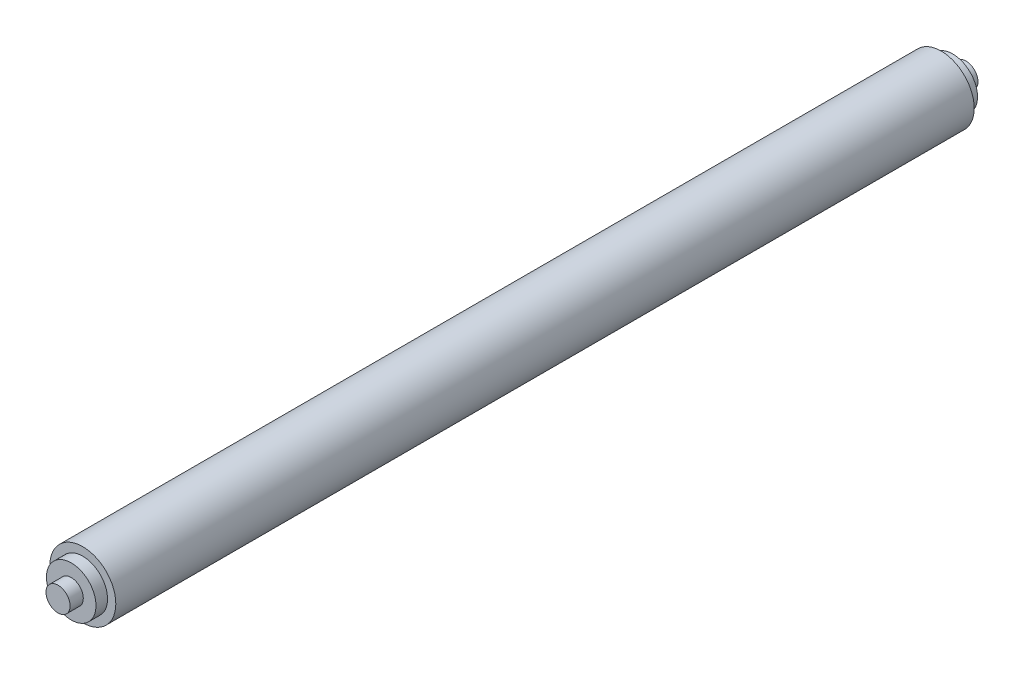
ISO-10303-21;
HEADER;
FILE_DESCRIPTION(('STEP AP214'),'2;1');
FILE_NAME('part.step','',(''),(''),'','','');
FILE_SCHEMA(('AUTOMOTIVE_DESIGN { 1 0 10303 214 1 1 1 1 }'));
ENDSEC;
DATA;
#1=APPLICATION_CONTEXT('core data for automotive mechanical design processes');
#2=APPLICATION_PROTOCOL_DEFINITION('international standard','automotive_design',2000,#1);
#3=PRODUCT_CONTEXT('',#1,'mechanical');
#4=PRODUCT('Part','Part','',(#3));
#5=PRODUCT_RELATED_PRODUCT_CATEGORY('part','',(#4));
#6=PRODUCT_DEFINITION_FORMATION('','',#4);
#7=PRODUCT_DEFINITION_CONTEXT('part definition',#1,'design');
#8=PRODUCT_DEFINITION('design','',#6,#7);
#9=PRODUCT_DEFINITION_SHAPE('','',#8);
#10=(LENGTH_UNIT() NAMED_UNIT(*) SI_UNIT(.MILLI.,.METRE.));
#11=(NAMED_UNIT(*) PLANE_ANGLE_UNIT() SI_UNIT($,.RADIAN.));
#12=(NAMED_UNIT(*) SI_UNIT($,.STERADIAN.) SOLID_ANGLE_UNIT());
#13=UNCERTAINTY_MEASURE_WITH_UNIT(LENGTH_MEASURE(1.E-05),#10,'distance_accuracy_value','');
#14=(GEOMETRIC_REPRESENTATION_CONTEXT(3) GLOBAL_UNCERTAINTY_ASSIGNED_CONTEXT((#13)) GLOBAL_UNIT_ASSIGNED_CONTEXT((#10,
#11,#12)) REPRESENTATION_CONTEXT('',''));
#15=CARTESIAN_POINT('',(0.,0.,0.));
#16=DIRECTION('',(0.,0.,1.));
#17=DIRECTION('',(1.,0.,0.));
#18=AXIS2_PLACEMENT_3D('',#15,#16,#17);
#19=CARTESIAN_POINT('',(0.,0.,-349.25));
#20=DIRECTION('',(0.,0.,1.));
#21=DIRECTION('',(1.,0.,0.));
#22=AXIS2_PLACEMENT_3D('',#19,#20,#21);
#23=CYLINDRICAL_SURFACE('',#22,19.05);
#24=CARTESIAN_POINT('',(0.,0.,-330.2));
#25=DIRECTION('',(0.,0.,1.));
#26=DIRECTION('',(1.,0.,0.));
#27=AXIS2_PLACEMENT_3D('',#24,#25,#26);
#28=CIRCLE('',#27,19.05);
#29=CARTESIAN_POINT('',(19.05,0.,-330.2));
#30=VERTEX_POINT('',#29);
#31=EDGE_CURVE('E52',#30,#30,#28,.T.);
#32=CARTESIAN_POINT('',(0.,0.,-339.09));
#33=DIRECTION('',(0.,0.,1.));
#34=DIRECTION('',(1.,0.,0.));
#35=AXIS2_PLACEMENT_3D('',#32,#33,#34);
#36=CIRCLE('',#35,19.05);
#37=CARTESIAN_POINT('',(19.05,0.,-339.09));
#38=VERTEX_POINT('',#37);
#39=EDGE_CURVE('E57',#38,#38,#36,.T.);
#40=CARTESIAN_POINT('',(19.05,0.,-330.2));
#41=CARTESIAN_POINT('',(19.05,0.,-330.292604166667));
#42=CARTESIAN_POINT('',(19.05,0.,-330.385208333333));
#43=CARTESIAN_POINT('',(19.05,0.,-330.570416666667));
#44=CARTESIAN_POINT('',(19.05,0.,-330.663020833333));
#45=CARTESIAN_POINT('',(19.05,0.,-330.848229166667));
#46=CARTESIAN_POINT('',(19.05,0.,-330.940833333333));
#47=CARTESIAN_POINT('',(19.05,0.,-331.126041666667));
#48=CARTESIAN_POINT('',(19.05,0.,-331.218645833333));
#49=CARTESIAN_POINT('',(19.05,0.,-331.403854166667));
#50=CARTESIAN_POINT('',(19.05,0.,-331.496458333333));
#51=CARTESIAN_POINT('',(19.05,0.,-331.681666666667));
#52=CARTESIAN_POINT('',(19.05,0.,-331.774270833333));
#53=CARTESIAN_POINT('',(19.05,0.,-331.959479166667));
#54=CARTESIAN_POINT('',(19.05,0.,-332.052083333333));
#55=CARTESIAN_POINT('',(19.05,0.,-332.237291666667));
#56=CARTESIAN_POINT('',(19.05,0.,-332.329895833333));
#57=CARTESIAN_POINT('',(19.05,0.,-332.515104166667));
#58=CARTESIAN_POINT('',(19.05,0.,-332.607708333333));
#59=CARTESIAN_POINT('',(19.05,0.,-332.792916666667));
#60=CARTESIAN_POINT('',(19.05,0.,-332.885520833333));
#61=CARTESIAN_POINT('',(19.05,0.,-333.070729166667));
#62=CARTESIAN_POINT('',(19.05,0.,-333.163333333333));
#63=CARTESIAN_POINT('',(19.05,0.,-333.348541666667));
#64=CARTESIAN_POINT('',(19.05,0.,-333.441145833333));
#65=CARTESIAN_POINT('',(19.05,0.,-333.626354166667));
#66=CARTESIAN_POINT('',(19.05,0.,-333.718958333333));
#67=CARTESIAN_POINT('',(19.05,0.,-333.904166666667));
#68=CARTESIAN_POINT('',(19.05,0.,-333.996770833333));
#69=CARTESIAN_POINT('',(19.05,0.,-334.181979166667));
#70=CARTESIAN_POINT('',(19.05,0.,-334.274583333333));
#71=CARTESIAN_POINT('',(19.05,0.,-334.459791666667));
#72=CARTESIAN_POINT('',(19.05,0.,-334.552395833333));
#73=CARTESIAN_POINT('',(19.05,0.,-334.737604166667));
#74=CARTESIAN_POINT('',(19.05,0.,-334.830208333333));
#75=CARTESIAN_POINT('',(19.05,0.,-335.015416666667));
#76=CARTESIAN_POINT('',(19.05,0.,-335.108020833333));
#77=CARTESIAN_POINT('',(19.05,0.,-335.293229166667));
#78=CARTESIAN_POINT('',(19.05,0.,-335.385833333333));
#79=CARTESIAN_POINT('',(19.05,0.,-335.571041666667));
#80=CARTESIAN_POINT('',(19.05,0.,-335.663645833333));
#81=CARTESIAN_POINT('',(19.05,0.,-335.848854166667));
#82=CARTESIAN_POINT('',(19.05,0.,-335.941458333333));
#83=CARTESIAN_POINT('',(19.05,0.,-336.126666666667));
#84=CARTESIAN_POINT('',(19.05,0.,-336.219270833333));
#85=CARTESIAN_POINT('',(19.05,0.,-336.404479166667));
#86=CARTESIAN_POINT('',(19.05,0.,-336.497083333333));
#87=CARTESIAN_POINT('',(19.05,0.,-336.682291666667));
#88=CARTESIAN_POINT('',(19.05,0.,-336.774895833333));
#89=CARTESIAN_POINT('',(19.05,0.,-336.960104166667));
#90=CARTESIAN_POINT('',(19.05,0.,-337.052708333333));
#91=CARTESIAN_POINT('',(19.05,0.,-337.237916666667));
#92=CARTESIAN_POINT('',(19.05,0.,-337.330520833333));
#93=CARTESIAN_POINT('',(19.05,0.,-337.515729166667));
#94=CARTESIAN_POINT('',(19.05,0.,-337.608333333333));
#95=CARTESIAN_POINT('',(19.05,0.,-337.793541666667));
#96=CARTESIAN_POINT('',(19.05,0.,-337.886145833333));
#97=CARTESIAN_POINT('',(19.05,0.,-338.071354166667));
#98=CARTESIAN_POINT('',(19.05,0.,-338.163958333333));
#99=CARTESIAN_POINT('',(19.05,0.,-338.349166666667));
#100=CARTESIAN_POINT('',(19.05,0.,-338.441770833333));
#101=CARTESIAN_POINT('',(19.05,0.,-338.626979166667));
#102=CARTESIAN_POINT('',(19.05,0.,-338.719583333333));
#103=CARTESIAN_POINT('',(19.05,0.,-338.904791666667));
#104=CARTESIAN_POINT('',(19.05,0.,-338.997395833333));
#105=CARTESIAN_POINT('',(19.05,0.,-339.09));
#106=B_SPLINE_CURVE_WITH_KNOTS('',3,(#40,#41,#42,#43,#44,#45,#46,#47,#48,#49,#50,#51,#52,#53,
#54,#55,#56,#57,#58,#59,#60,#61,#62,#63,#64,#65,#66,#67,#68,#69,#70,#71,#72,#73,#74,#75,#76,#77,
#78,#79,#80,#81,#82,#83,#84,#85,#86,#87,#88,#89,#90,#91,#92,#93,#94,#95,#96,#97,#98,#99,#100,
#101,#102,#103,#104,#105),.UNSPECIFIED.,.F.,.F.,(4,2,2,2,2,2,2,2,2,2,2,2,2,2,2,2,2,2,2,2,2,2,2,
2,2,2,2,2,2,2,2,2,4),(0.,0.27781250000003,0.555625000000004,0.833437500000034,1.11125000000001,
1.38906250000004,1.66687500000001,1.94468750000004,2.22250000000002,2.50031250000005,
2.77812500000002,3.05593750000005,3.33375000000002,3.61156250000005,3.88937500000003,
4.16718750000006,4.44500000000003,4.72281250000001,5.00062500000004,5.27843750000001,
5.55625000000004,5.83406250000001,6.11187500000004,6.38968750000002,6.66750000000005,
6.94531250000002,7.22312500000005,7.50093750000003,7.77875000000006,8.05656250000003,
8.33437500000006,8.61218750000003,8.89000000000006),.UNSPECIFIED.);
#107=EDGE_CURVE('BSEAM30',#30,#38,#106,.T.);
#108=ORIENTED_EDGE('',*,*,#31,.F.);
#109=ORIENTED_EDGE('',*,*,#39,.T.);
#110=ORIENTED_EDGE('',*,*,#107,.T.);
#111=ORIENTED_EDGE('',*,*,#107,.F.);
#112=EDGE_LOOP('',(#108,#110,#109,#111));
#113=FACE_BOUND('',#112,.T.);
#114=ADVANCED_FACE('F30',(#113),#23,.T.);
#115=CARTESIAN_POINT('',(0.,0.,349.25));
#116=DIRECTION('',(0.,0.,-1.));
#117=DIRECTION('',(-1.,0.,0.));
#118=AXIS2_PLACEMENT_3D('',#115,#116,#117);
#119=CYLINDRICAL_SURFACE('',#118,19.05);
#120=CARTESIAN_POINT('',(0.,0.,330.2));
#121=DIRECTION('',(0.,0.,1.));
#122=DIRECTION('',(1.,0.,0.));
#123=AXIS2_PLACEMENT_3D('',#120,#121,#122);
#124=CIRCLE('',#123,19.05);
#125=CARTESIAN_POINT('',(-19.05,0.,330.2));
#126=VERTEX_POINT('',#125);
#127=EDGE_CURVE('E41',#126,#126,#124,.T.);
#128=CARTESIAN_POINT('',(0.,0.,339.09));
#129=DIRECTION('',(0.,0.,1.));
#130=DIRECTION('',(1.,0.,0.));
#131=AXIS2_PLACEMENT_3D('',#128,#129,#130);
#132=CIRCLE('',#131,19.05);
#133=CARTESIAN_POINT('',(-19.05,0.,339.09));
#134=VERTEX_POINT('',#133);
#135=EDGE_CURVE('E45',#134,#134,#132,.T.);
#136=CARTESIAN_POINT('',(-19.05,0.,330.2));
#137=CARTESIAN_POINT('',(-19.05,0.,330.292604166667));
#138=CARTESIAN_POINT('',(-19.05,0.,330.385208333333));
#139=CARTESIAN_POINT('',(-19.05,0.,330.570416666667));
#140=CARTESIAN_POINT('',(-19.05,0.,330.663020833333));
#141=CARTESIAN_POINT('',(-19.05,0.,330.848229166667));
#142=CARTESIAN_POINT('',(-19.05,0.,330.940833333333));
#143=CARTESIAN_POINT('',(-19.05,0.,331.126041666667));
#144=CARTESIAN_POINT('',(-19.05,0.,331.218645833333));
#145=CARTESIAN_POINT('',(-19.05,0.,331.403854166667));
#146=CARTESIAN_POINT('',(-19.05,0.,331.496458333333));
#147=CARTESIAN_POINT('',(-19.05,0.,331.681666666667));
#148=CARTESIAN_POINT('',(-19.05,0.,331.774270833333));
#149=CARTESIAN_POINT('',(-19.05,0.,331.959479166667));
#150=CARTESIAN_POINT('',(-19.05,0.,332.052083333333));
#151=CARTESIAN_POINT('',(-19.05,0.,332.237291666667));
#152=CARTESIAN_POINT('',(-19.05,0.,332.329895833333));
#153=CARTESIAN_POINT('',(-19.05,0.,332.515104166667));
#154=CARTESIAN_POINT('',(-19.05,0.,332.607708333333));
#155=CARTESIAN_POINT('',(-19.05,0.,332.792916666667));
#156=CARTESIAN_POINT('',(-19.05,0.,332.885520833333));
#157=CARTESIAN_POINT('',(-19.05,0.,333.070729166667));
#158=CARTESIAN_POINT('',(-19.05,0.,333.163333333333));
#159=CARTESIAN_POINT('',(-19.05,0.,333.348541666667));
#160=CARTESIAN_POINT('',(-19.05,0.,333.441145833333));
#161=CARTESIAN_POINT('',(-19.05,0.,333.626354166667));
#162=CARTESIAN_POINT('',(-19.05,0.,333.718958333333));
#163=CARTESIAN_POINT('',(-19.05,0.,333.904166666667));
#164=CARTESIAN_POINT('',(-19.05,0.,333.996770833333));
#165=CARTESIAN_POINT('',(-19.05,0.,334.181979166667));
#166=CARTESIAN_POINT('',(-19.05,0.,334.274583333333));
#167=CARTESIAN_POINT('',(-19.05,0.,334.459791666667));
#168=CARTESIAN_POINT('',(-19.05,0.,334.552395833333));
#169=CARTESIAN_POINT('',(-19.05,0.,334.737604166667));
#170=CARTESIAN_POINT('',(-19.05,0.,334.830208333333));
#171=CARTESIAN_POINT('',(-19.05,0.,335.015416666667));
#172=CARTESIAN_POINT('',(-19.05,0.,335.108020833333));
#173=CARTESIAN_POINT('',(-19.05,0.,335.293229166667));
#174=CARTESIAN_POINT('',(-19.05,0.,335.385833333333));
#175=CARTESIAN_POINT('',(-19.05,0.,335.571041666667));
#176=CARTESIAN_POINT('',(-19.05,0.,335.663645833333));
#177=CARTESIAN_POINT('',(-19.05,0.,335.848854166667));
#178=CARTESIAN_POINT('',(-19.05,0.,335.941458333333));
#179=CARTESIAN_POINT('',(-19.05,0.,336.126666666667));
#180=CARTESIAN_POINT('',(-19.05,0.,336.219270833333));
#181=CARTESIAN_POINT('',(-19.05,0.,336.404479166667));
#182=CARTESIAN_POINT('',(-19.05,0.,336.497083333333));
#183=CARTESIAN_POINT('',(-19.05,0.,336.682291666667));
#184=CARTESIAN_POINT('',(-19.05,0.,336.774895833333));
#185=CARTESIAN_POINT('',(-19.05,0.,336.960104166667));
#186=CARTESIAN_POINT('',(-19.05,0.,337.052708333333));
#187=CARTESIAN_POINT('',(-19.05,0.,337.237916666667));
#188=CARTESIAN_POINT('',(-19.05,0.,337.330520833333));
#189=CARTESIAN_POINT('',(-19.05,0.,337.515729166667));
#190=CARTESIAN_POINT('',(-19.05,0.,337.608333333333));
#191=CARTESIAN_POINT('',(-19.05,0.,337.793541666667));
#192=CARTESIAN_POINT('',(-19.05,0.,337.886145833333));
#193=CARTESIAN_POINT('',(-19.05,0.,338.071354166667));
#194=CARTESIAN_POINT('',(-19.05,0.,338.163958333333));
#195=CARTESIAN_POINT('',(-19.05,0.,338.349166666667));
#196=CARTESIAN_POINT('',(-19.05,0.,338.441770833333));
#197=CARTESIAN_POINT('',(-19.05,0.,338.626979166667));
#198=CARTESIAN_POINT('',(-19.05,0.,338.719583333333));
#199=CARTESIAN_POINT('',(-19.05,0.,338.904791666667));
#200=CARTESIAN_POINT('',(-19.05,0.,338.997395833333));
#201=CARTESIAN_POINT('',(-19.05,0.,339.09));
#202=B_SPLINE_CURVE_WITH_KNOTS('',3,(#136,#137,#138,#139,#140,#141,#142,#143,#144,#145,#146,
#147,#148,#149,#150,#151,#152,#153,#154,#155,#156,#157,#158,#159,#160,#161,#162,#163,#164,#165,
#166,#167,#168,#169,#170,#171,#172,#173,#174,#175,#176,#177,#178,#179,#180,#181,#182,#183,#184,
#185,#186,#187,#188,#189,#190,#191,#192,#193,#194,#195,#196,#197,#198,#199,#200,#201),
.UNSPECIFIED.,.F.,.F.,(4,2,2,2,2,2,2,2,2,2,2,2,2,2,2,2,2,2,2,2,2,2,2,2,2,2,2,2,2,2,2,2,4),(0.,
0.277812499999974,0.555625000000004,0.833437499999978,1.11124999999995,1.38906249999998,
1.66687499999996,1.94468749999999,2.22249999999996,2.50031249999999,2.77812499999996,
3.05593749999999,3.33374999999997,3.6115625,3.88937499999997,4.1671875,4.44499999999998,
4.72281249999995,5.00062499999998,5.27843749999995,5.55624999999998,5.83406249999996,
6.11187499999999,6.38968749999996,6.66749999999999,6.94531249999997,7.223125,7.50093749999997,
7.77875,8.05656249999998,8.334375,8.61218749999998,8.88999999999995),.UNSPECIFIED.);
#203=EDGE_CURVE('BSEAM83',#126,#134,#202,.T.);
#204=ORIENTED_EDGE('',*,*,#127,.T.);
#205=ORIENTED_EDGE('',*,*,#135,.F.);
#206=ORIENTED_EDGE('',*,*,#203,.T.);
#207=ORIENTED_EDGE('',*,*,#203,.F.);
#208=EDGE_LOOP('',(#204,#206,#205,#207));
#209=FACE_BOUND('',#208,.T.);
#210=ADVANCED_FACE('F83',(#209),#119,.T.);
#211=CARTESIAN_POINT('',(0.,0.,330.2));
#212=DIRECTION('',(0.,0.,1.));
#213=DIRECTION('',(1.,0.,0.));
#214=AXIS2_PLACEMENT_3D('',#211,#212,#213);
#215=PLANE('',#214);
#216=CARTESIAN_POINT('',(0.,0.,330.2));
#217=DIRECTION('',(0.,0.,1.));
#218=DIRECTION('',(1.,0.,0.));
#219=AXIS2_PLACEMENT_3D('',#216,#217,#218);
#220=CIRCLE('',#219,25.4);
#221=CARTESIAN_POINT('',(25.4,0.,330.2));
#222=VERTEX_POINT('',#221);
#223=EDGE_CURVE('E10',#222,#222,#220,.T.);
#224=ORIENTED_EDGE('',*,*,#223,.T.);
#225=EDGE_LOOP('',(#224));
#226=FACE_BOUND('',#225,.T.);
#227=ORIENTED_EDGE('',*,*,#127,.F.);
#228=EDGE_LOOP('',(#227));
#229=FACE_BOUND('',#228,.T.);
#230=ADVANCED_FACE('F88',(#226,#229),#215,.T.);
#231=CARTESIAN_POINT('',(0.,0.,330.2));
#232=DIRECTION('',(0.,0.,-1.));
#233=DIRECTION('',(-1.,0.,0.));
#234=AXIS2_PLACEMENT_3D('',#231,#232,#233);
#235=CYLINDRICAL_SURFACE('',#234,25.4);
#236=ORIENTED_EDGE('',*,*,#223,.F.);
#237=EDGE_LOOP('',(#236));
#238=FACE_BOUND('',#237,.T.);
#239=CARTESIAN_POINT('',(0.,0.,-330.2));
#240=DIRECTION('',(0.,0.,1.));
#241=DIRECTION('',(1.,0.,0.));
#242=AXIS2_PLACEMENT_3D('',#239,#240,#241);
#243=CIRCLE('',#242,25.4);
#244=CARTESIAN_POINT('',(25.4,0.,-330.2));
#245=VERTEX_POINT('',#244);
#246=EDGE_CURVE('E34',#245,#245,#243,.T.);
#247=ORIENTED_EDGE('',*,*,#246,.T.);
#248=EDGE_LOOP('',(#247));
#249=FACE_BOUND('',#248,.T.);
#250=ADVANCED_FACE('F32',(#238,#249),#235,.T.);
#251=CARTESIAN_POINT('',(0.,0.,-330.2));
#252=DIRECTION('',(0.,0.,1.));
#253=DIRECTION('',(1.,0.,0.));
#254=AXIS2_PLACEMENT_3D('',#251,#252,#253);
#255=PLANE('',#254);
#256=ORIENTED_EDGE('',*,*,#31,.T.);
#257=EDGE_LOOP('',(#256));
#258=FACE_BOUND('',#257,.T.);
#259=ORIENTED_EDGE('',*,*,#246,.F.);
#260=EDGE_LOOP('',(#259));
#261=FACE_BOUND('',#260,.T.);
#262=ADVANCED_FACE('F102',(#258,#261),#255,.F.);
#263=CARTESIAN_POINT('',(0.,0.,339.09));
#264=DIRECTION('',(0.,0.,1.));
#265=DIRECTION('',(1.,0.,0.));
#266=AXIS2_PLACEMENT_3D('',#263,#264,#265);
#267=PLANE('',#266);
#268=CARTESIAN_POINT('',(0.,0.,339.09));
#269=DIRECTION('',(0.,0.,1.));
#270=DIRECTION('',(1.,0.,0.));
#271=AXIS2_PLACEMENT_3D('',#268,#269,#270);
#272=CIRCLE('',#271,9.271);
#273=CARTESIAN_POINT('',(9.271,0.,339.09));
#274=VERTEX_POINT('',#273);
#275=EDGE_CURVE('E48',#274,#274,#272,.T.);
#276=ORIENTED_EDGE('',*,*,#275,.F.);
#277=EDGE_LOOP('',(#276));
#278=FACE_BOUND('',#277,.T.);
#279=ORIENTED_EDGE('',*,*,#135,.T.);
#280=EDGE_LOOP('',(#279));
#281=FACE_BOUND('',#280,.T.);
#282=ADVANCED_FACE('F98',(#278,#281),#267,.T.);
#283=CARTESIAN_POINT('',(0.,0.,339.09));
#284=DIRECTION('',(0.,0.,1.));
#285=DIRECTION('',(1.,0.,0.));
#286=AXIS2_PLACEMENT_3D('',#283,#284,#285);
#287=CYLINDRICAL_SURFACE('',#286,9.271);
#288=ORIENTED_EDGE('',*,*,#275,.T.);
#289=EDGE_LOOP('',(#288));
#290=FACE_BOUND('',#289,.T.);
#291=CARTESIAN_POINT('',(0.,0.,349.25));
#292=DIRECTION('',(0.,0.,1.));
#293=DIRECTION('',(1.,0.,0.));
#294=AXIS2_PLACEMENT_3D('',#291,#292,#293);
#295=CIRCLE('',#294,9.271);
#296=CARTESIAN_POINT('',(9.271,0.,349.25));
#297=VERTEX_POINT('',#296);
#298=EDGE_CURVE('E49',#297,#297,#295,.T.);
#299=ORIENTED_EDGE('',*,*,#298,.F.);
#300=EDGE_LOOP('',(#299));
#301=FACE_BOUND('',#300,.T.);
#302=ADVANCED_FACE('F94',(#290,#301),#287,.T.);
#303=CARTESIAN_POINT('',(0.,0.,349.25));
#304=DIRECTION('',(0.,0.,1.));
#305=DIRECTION('',(1.,0.,0.));
#306=AXIS2_PLACEMENT_3D('',#303,#304,#305);
#307=PLANE('',#306);
#308=ORIENTED_EDGE('',*,*,#298,.T.);
#309=EDGE_LOOP('',(#308));
#310=FACE_BOUND('',#309,.T.);
#311=ADVANCED_FACE('F97',(#310),#307,.T.);
#312=CARTESIAN_POINT('',(0.,0.,-339.09));
#313=DIRECTION('',(0.,0.,-1.));
#314=DIRECTION('',(1.,0.,0.));
#315=AXIS2_PLACEMENT_3D('',#312,#313,#314);
#316=PLANE('',#315);
#317=ORIENTED_EDGE('',*,*,#39,.F.);
#318=EDGE_LOOP('',(#317));
#319=FACE_BOUND('',#318,.T.);
#320=CARTESIAN_POINT('',(0.,0.,-339.09));
#321=DIRECTION('',(0.,0.,1.));
#322=DIRECTION('',(1.,0.,0.));
#323=AXIS2_PLACEMENT_3D('',#320,#321,#322);
#324=CIRCLE('',#323,9.271);
#325=CARTESIAN_POINT('',(9.271,0.,-339.09));
#326=VERTEX_POINT('',#325);
#327=EDGE_CURVE('E60',#326,#326,#324,.T.);
#328=ORIENTED_EDGE('',*,*,#327,.T.);
#329=EDGE_LOOP('',(#328));
#330=FACE_BOUND('',#329,.T.);
#331=ADVANCED_FACE('F67',(#319,#330),#316,.T.);
#332=CARTESIAN_POINT('',(0.,0.,-339.09));
#333=DIRECTION('',(0.,0.,-1.));
#334=DIRECTION('',(-1.,0.,0.));
#335=AXIS2_PLACEMENT_3D('',#332,#333,#334);
#336=CYLINDRICAL_SURFACE('',#335,9.271);
#337=ORIENTED_EDGE('',*,*,#327,.F.);
#338=EDGE_LOOP('',(#337));
#339=FACE_BOUND('',#338,.T.);
#340=CARTESIAN_POINT('',(0.,0.,-349.25));
#341=DIRECTION('',(0.,0.,1.));
#342=DIRECTION('',(1.,0.,0.));
#343=AXIS2_PLACEMENT_3D('',#340,#341,#342);
#344=CIRCLE('',#343,9.271);
#345=CARTESIAN_POINT('',(9.271,0.,-349.25));
#346=VERTEX_POINT('',#345);
#347=EDGE_CURVE('E61',#346,#346,#344,.T.);
#348=ORIENTED_EDGE('',*,*,#347,.T.);
#349=EDGE_LOOP('',(#348));
#350=FACE_BOUND('',#349,.T.);
#351=ADVANCED_FACE('F69',(#339,#350),#336,.T.);
#352=CARTESIAN_POINT('',(0.,0.,-349.25));
#353=DIRECTION('',(0.,0.,-1.));
#354=DIRECTION('',(1.,0.,0.));
#355=AXIS2_PLACEMENT_3D('',#352,#353,#354);
#356=PLANE('',#355);
#357=ORIENTED_EDGE('',*,*,#347,.F.);
#358=EDGE_LOOP('',(#357));
#359=FACE_BOUND('',#358,.T.);
#360=ADVANCED_FACE('F72',(#359),#356,.T.);
#361=CLOSED_SHELL('',(#114,#210,#230,#250,#262,#282,#302,#311,#331,#351,#360));
#362=MANIFOLD_SOLID_BREP('B2',#361);
#363=ADVANCED_BREP_SHAPE_REPRESENTATION('',(#18,#362),#14);
#364=SHAPE_DEFINITION_REPRESENTATION(#9,#363);
ENDSEC;
END-ISO-10303-21;
